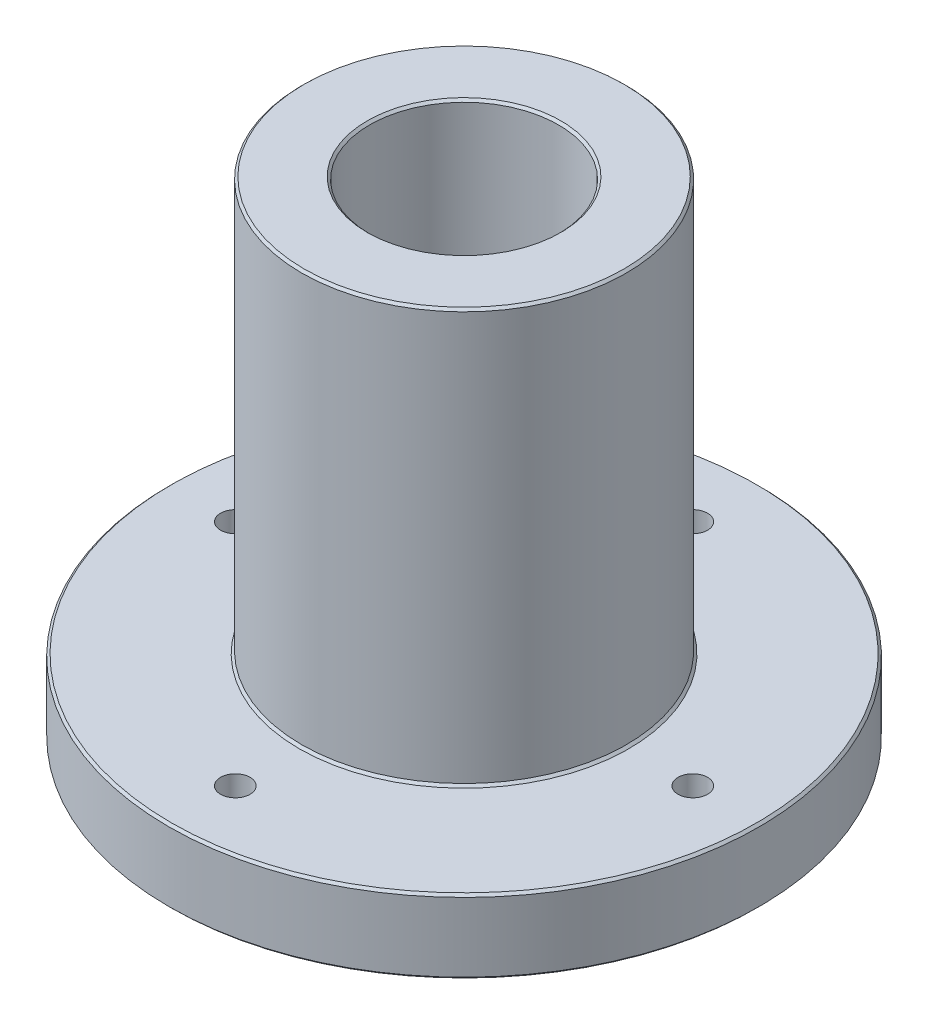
from build123d import *

# Parameters (mm, degrees)
SKETCH1_R           = 31.75
SKETCH1_R_2         = 10.16
BOSS_EXTRUDE1_DEPTH = 7.9375
SKETCH2_R           = 17.4625
SKETCH2_R_2         = 10.16
BOSS_EXTRUDE2_DEPTH = 44.45
SKETCH3_R           = 1.5875
CUT_EXTRUDE1_DEPTH  = 64.181702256
CHAMFER1_SIZE       = 0.254


with BuildPart() as part:
    # Sketch1 → Boss-Extrude1 (new body)
    with BuildSketch(Plane(origin=(0, 0, 0), x_dir=(1, 0, 0), z_dir=(0, 1, 0))):
        with Locations(Location((0, 0, 0), (0, 0, 270))):
            Circle(SKETCH1_R)
        with Locations(Location((0, 0, 0), (0, 0, 270))):
            Circle(SKETCH1_R_2, mode=Mode.SUBTRACT)
    extrude(amount=BOSS_EXTRUDE1_DEPTH)

    # Sketch2 → Boss-Extrude2 (add)
    with BuildSketch(Plane(origin=(0, 7.9375, 0), x_dir=(1, 0, 0), z_dir=(0, 1, 0))):
        with Locations(Location((0, 0, 0), (0, 0, 270))):
            Circle(SKETCH2_R)
        with Locations(Location((0, 0, 0), (0, 0, 270))):
            Circle(SKETCH2_R_2, mode=Mode.SUBTRACT)
    extrude(amount=BOSS_EXTRUDE2_DEPTH)

    # Sketch3 → Cut-Extrude1 (cut, through all)
    with BuildSketch(Plane(origin=(0, 7.9375, 0), x_dir=(1, 0, 0), z_dir=(0, 1, 0))):
        with Locations(Location((-24.60625, 0, 0), (0, 0, 270))):
            Circle(SKETCH3_R)
        with Locations(Location((0, 24.60625, 0), (0, 0, 270))):
            Circle(SKETCH3_R)
        with Locations(Location((24.60625, 0, 0), (0, 0, 270))):
            Circle(SKETCH3_R)
        with Locations(Location((0, -24.60625, 0), (0, 0, 270))):
            Circle(SKETCH3_R)
    extrude(amount=-CUT_EXTRUDE1_DEPTH, mode=Mode.SUBTRACT)

    # Chamfer1
    chamfer1_edges = [part.edges().sort_by_distance(p)[0] for p in [
        (0, 52.3875, -17.4625),
        (0, 7.9375, -17.4625),
        (0, 52.3875, -10.16),
        (0, 0, -31.75),
        (0, 7.9375, -31.75),
    ]]
    chamfer(chamfer1_edges, length=CHAMFER1_SIZE)


solid = part.part
